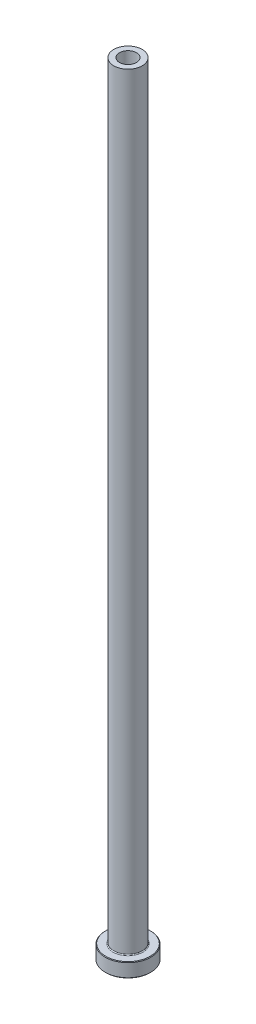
from build123d import *

# Parameters (mm, degrees)
FILLET1_R     = 0.3
CHAMFER1_SIZE = 0.2
CHAMFER3_SIZE = 0.5


with BuildPart() as part:
    # Sketch1 → Revolve1 (revolve)
    with BuildSketch(Plane.XY, mode=Mode.PRIVATE) as revolve1_sk:
        Polygon((-3, 275), (-5, 275), (-5, 5), (-8, 5), (-8, 0), (-3.25, 0), (-3.25, 218), (-3, 230), align=None)
    revolve(revolve1_sk.sketch.rotate(Axis((0, 92.187680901, 0), (0, -1, 0)), 270), axis=Axis((0, 92.187680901, 0), (0, -1, 0)))

    # Fillet1
    fillet1_edges = [part.edges().sort_by_distance(p)[0] for p in [
        (0, 5, -5),
    ]]
    fillet(fillet1_edges, radius=FILLET1_R)

    # Chamfer1
    chamfer1_edges = [part.edges().sort_by_distance(p)[0] for p in [
        (0, 0, -8),
        (0, 5, -8),
    ]]
    chamfer(chamfer1_edges, length=CHAMFER1_SIZE)

    # Chamfer3
    chamfer3_edges = [part.edges().sort_by_distance(p)[0] for p in [
        (0, 0, -3.25),
    ]]
    chamfer(chamfer3_edges, length=CHAMFER3_SIZE)


solid = part.part
